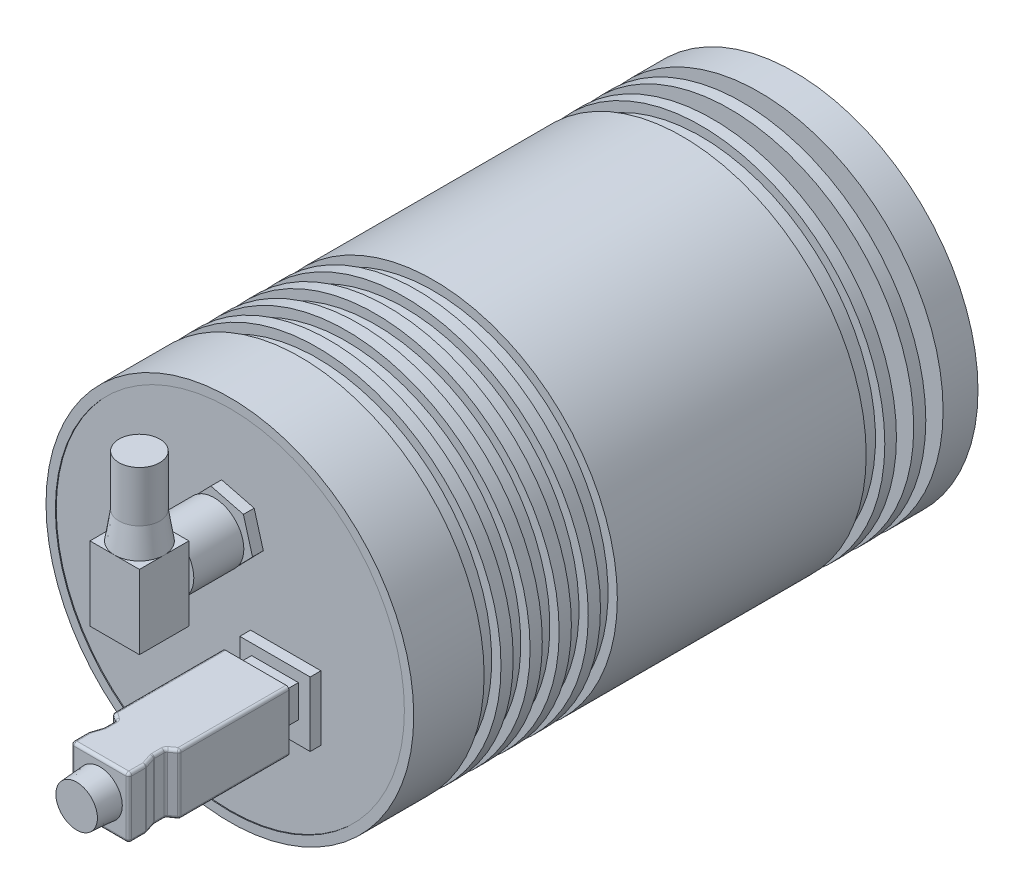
from build123d import *

# Parameters (mm, degrees)
SKETCH1_R           = 31.61
EXTRUDE1_DEPTH      = 97
SKETCH2_W           = 6.75
SKETCH2_H           = 2.97
LPATTERN1_COUNT     = 2
LPATTERN1_PITCH     = 5.05
SKETCH3_W           = 1.6
SKETCH3_H           = 3.2
SKETCH4_W           = 1.6
SKETCH4_H           = 2.9
LPATTERN2_COUNT     = 5
LPATTERN2_PITCH     = 5
SKETCH13_R          = 30
CUT_EXTRUDE2_DEPTH  = 0.15
EXTRUDE2_DEPTH      = 97
EXTRUDE2_DEPTH_BACK = 1.7
SKETCH5_W           = 12.1
SKETCH5_H           = 11.1
EXTRUDE7_DEPTH      = 1.85
SKETCH15_R          = 3.27
EXTRUDE8_DEPTH      = 1
SKETCH16_R          = 5.1
EXTRUDE9_DEPTH      = 8.6
SKETCH17_W          = 8.5
SKETCH17_H          = 12.7
EXTRUDE10_DEPTH     = 8.5
SKETCH18_R          = 4.25
EXTRUDE11_DEPTH     = 4.7
EXTRUDE11_DRAFT     = -9
SKETCH19_R          = 3.50559313
EXTRUDE12_DEPTH     = 8.7
SKETCH6_W           = 8.05
SKETCH6_H           = 7.25
EXTRUDE3_DEPTH      = 3.3
CHAMFER1_SIZE       = 1.7
SKETCH7_W           = 11.4
SKETCH7_H           = 10.4
EXTRUDE4_DEPTH      = 26.8
CUT_EXTRUDE1_DEPTH  = 140.540930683
SKETCH9_R           = 3.85
EXTRUDE5_DEPTH      = 4
EXTRUDE5_TAPER      = 4
FILLET1_R           = 0.5


with BuildPart() as part:
    # Sketch1 → Extrude1 (new body)
    with BuildSketch(Plane.XY):
        with Locations(Location((0, 0, 0), (0, 0, 180))):
            Circle(SKETCH1_R)
    extrude(amount=EXTRUDE1_DEPTH)

    # Sketch2 → Cut-Revolve1 (revolve, cut)
    with BuildSketch(Plane(origin=(0, 0, 0), x_dir=(1, 0, 0), z_dir=(0, 1, 0)), mode=Mode.PRIVATE) as cut_revolve1_sk:
        with Locations((28.235, -7.485)):
            Rectangle(SKETCH2_W, SKETCH2_H)
    cut_revolve1 = revolve(cut_revolve1_sk.sketch.rotate(Axis((0, 0, 0), (0, 0, 1)), 180), axis=Axis((0, 0, 0), (0, 0, 1)), mode=Mode.SUBTRACT)

    # LPattern1: Cut-Revolve1 ×2
    with Locations(*[(0, 0, i * LPATTERN1_PITCH) for i in range(1, LPATTERN1_COUNT)]):
        add(cut_revolve1, mode=Mode.SUBTRACT)

    # Sketch3 → Cut-Revolve2 (revolve, cut)
    with BuildSketch(Plane(origin=(0, 0, 0), x_dir=(1, 0, 0), z_dir=(0, 1, 0)), mode=Mode.PRIVATE) as cut_revolve2_sk:
        with Locations((30.81, -17.62)):
            Rectangle(SKETCH3_W, SKETCH3_H)
    revolve(cut_revolve2_sk.sketch.rotate(Axis((0, 0, 0), (0, 0, 1)), 180), axis=Axis((0, 0, 0), (0, 0, 1)), mode=Mode.SUBTRACT)

    # Sketch4 → Cut-Revolve3 (revolve, cut)
    with BuildSketch(Plane(origin=(0, 0, 0), x_dir=(1, 0, 0), z_dir=(0, 1, 0)), mode=Mode.PRIVATE) as cut_revolve3_sk:
        with Locations((30.81, -83.45)):
            Rectangle(SKETCH4_W, SKETCH4_H)
    cut_revolve3 = revolve(cut_revolve3_sk.sketch.rotate(Axis((0, 0, 0), (0, 0, 1)), 180), axis=Axis((0, 0, 0), (0, 0, 1)), mode=Mode.SUBTRACT)

    # LPattern2: Cut-Revolve3 ×5
    with Locations(*[(0, 0, -i * LPATTERN2_PITCH) for i in range(1, LPATTERN2_COUNT)]):
        add(cut_revolve3, mode=Mode.SUBTRACT)

    # Sketch13 → Cut-Extrude2 (cut)
    with BuildSketch(Plane.XY.offset(97)):
        Circle(SKETCH13_R)
    extrude(amount=-CUT_EXTRUDE2_DEPTH, mode=Mode.SUBTRACT)

    # Sketch5 → Extrude2 (add, two sides: drawn at the far end of the back side and taken through both)
    with BuildSketch(Plane(origin=(0, 0, 97), x_dir=(-1, 0, 0), z_dir=(0, 0, -1)).offset(-EXTRUDE2_DEPTH_BACK)):
        with Locations((-9.457, -6.934)):
            Rectangle(SKETCH5_W, SKETCH5_H)
    extrude(amount=EXTRUDE2_DEPTH + EXTRUDE2_DEPTH_BACK)

    # Sketch14 → Extrude7 (add)
    with BuildSketch(Plane.XY.offset(96.85)):
        Polygon((-4.027570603, 8.812533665), (1.568672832, 7.392888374), (5.596243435, 11.52955471), (4.027570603, 17.085866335), (-1.568672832, 18.505511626), (-5.596243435, 14.36884529), align=None)
    extrude(amount=EXTRUDE7_DEPTH)

    # Sketch15 → Extrude8 (add)
    with BuildSketch(Plane.XY.offset(98.7)):
        with Locations((0, 12.9492)):
            Circle(SKETCH15_R)
    extrude(amount=EXTRUDE8_DEPTH)

    # Sketch16 → Extrude9 (add)
    with BuildSketch(Plane.XY.offset(99.7)):
        with Locations(Location((0, 12.9492, 0), (0, 0, 180))):
            Circle(SKETCH16_R)
    extrude(amount=EXTRUDE9_DEPTH)

    # Sketch17 → Extrude10 (add)
    with BuildSketch(Plane.XY.offset(108.3)):
        with Locations((0, 11.6992)):
            Rectangle(SKETCH17_W, SKETCH17_H)
    extrude(amount=EXTRUDE10_DEPTH)


with BuildPart() as extrude11_tool:
    # Sketch18 → Extrude11 (with draft: the straight prism first)
    with BuildSketch(Plane.XZ.offset(-18.0492)):
        with Locations((0, 112.55)):
            Circle(SKETCH18_R)
    extrude(amount=-EXTRUDE11_DEPTH)
    # Extrude11: the draft: its side faces are tilted about the plane it starts from
    extrude11_sides = [extrude11_tool.faces().sort_by_distance(p)[0] for p in [
        (-4.25, 20.3992, 112.55),
    ]]
    draft(extrude11_sides, Plane.XZ.offset(-18.0492), EXTRUDE11_DRAFT)


with BuildPart() as part_1:
    add(part.part)

    # Extrude11: add extrude11_tool
    add(extrude11_tool.part)

    # Sketch19 → Extrude12 (add)
    with BuildSketch(Plane(origin=(0, 22.7492, 0), x_dir=(-1, 0, 0), z_dir=(0, 1, 0))):
        with Locations(Location((0, 112.55, 0), (0, 0, 90))):
            Circle(SKETCH19_R)
    extrude(amount=EXTRUDE12_DEPTH)

    # Sketch6 → Extrude3 (add)
    with BuildSketch(Plane.XY.offset(98.7)):
        with Locations((9.457, -6.859)):
            Rectangle(SKETCH6_W, SKETCH6_H)
    extrude(amount=EXTRUDE3_DEPTH)

    # Chamfer1
    chamfer1_edges = [part_1.edges().sort_by_distance(p)[0] for p in [
        (5.432, -10.484, 100.35),
        (13.482, -10.484, 100.35),
    ]]
    chamfer(chamfer1_edges, length=CHAMFER1_SIZE)

    # Sketch7 → Extrude4 (add)
    with BuildSketch(Plane.XY.offset(102)):
        with Locations((9.457, -6.584)):
            Rectangle(SKETCH7_W, SKETCH7_H)
    extrude(amount=EXTRUDE4_DEPTH)

    # Sketch8 → Cut-Extrude1 (cut, through all)
    with BuildSketch(Plane.XZ.offset(11.784)):
        Polygon((15.157, 120.8), (13.757, 121.8), (13.757, 123.8), (14.407, 125.8), (14.407, 128.8), (4.507, 128.8), (4.507, 125.8), (5.157, 123.8), (5.157, 121.8), (3.757, 120.8), (3.757, 134.764695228), (15.157, 134.764695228), align=None)
    extrude(amount=-CUT_EXTRUDE1_DEPTH, mode=Mode.SUBTRACT)

    # Sketch9 → Extrude5 (add)
    with BuildSketch(Plane.XY.offset(128.8)):
        with Locations((9.457, -6.584)):
            Circle(SKETCH9_R)
    extrude(amount=EXTRUDE5_DEPTH, taper=EXTRUDE5_TAPER)

    # Fillet1
    fillet1_edges = [part_1.edges().sort_by_distance(p)[0] for p in [
        (9.457, -11.784, 128.8),
        (9.457, -1.384, 128.8),
        (4.507, -6.584, 128.8),
        (14.407, -6.584, 128.8),
        (3.757, -1.384, 111.4),
        (15.157, -1.384, 111.4),
        (4.457, -1.384, 121.3),
        (5.157, -1.384, 122.8),
        (4.832, -1.384, 124.8),
        (14.082, -1.384, 124.8),
        (13.757, -1.384, 122.8),
        (14.457, -1.384, 121.3),
        (15.157, -11.784, 111.4),
        (3.757, -11.784, 111.4),
        (15.157, -6.584, 120.8),
        (13.757, -6.584, 121.8),
        (13.757, -6.584, 123.8),
        (4.507, -6.584, 125.8),
        (5.157, -6.584, 123.8),
        (5.157, -6.584, 121.8),
        (14.407, -1.384, 127.3),
        (14.407, -6.584, 125.8),
        (4.507, -1.384, 127.3),
        (3.757, -6.584, 120.8),
        (14.407, -11.784, 127.3),
        (14.082, -11.784, 124.8),
        (13.757, -11.784, 122.8),
        (14.457, -11.784, 121.3),
        (4.507, -11.784, 127.3),
        (4.457, -11.784, 121.3),
        (5.157, -11.784, 122.8),
        (4.832, -11.784, 124.8),
    ]]
    fillet(fillet1_edges, radius=FILLET1_R)


solid = part_1.part
